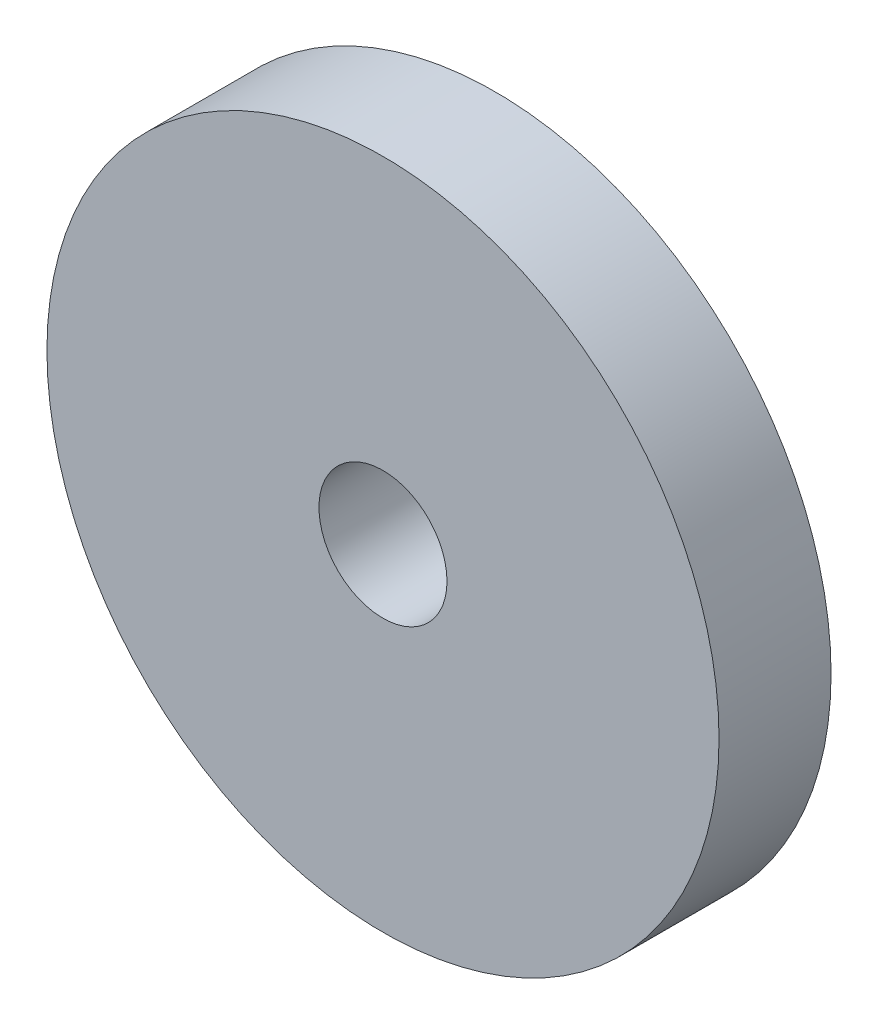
ISO-10303-21;
HEADER;
FILE_DESCRIPTION(('STEP AP214'),'2;1');
FILE_NAME('part.step','',(''),(''),'','','');
FILE_SCHEMA(('AUTOMOTIVE_DESIGN { 1 0 10303 214 1 1 1 1 }'));
ENDSEC;
DATA;
#1=APPLICATION_CONTEXT('core data for automotive mechanical design processes');
#2=APPLICATION_PROTOCOL_DEFINITION('international standard','automotive_design',2000,#1);
#3=PRODUCT_CONTEXT('',#1,'mechanical');
#4=PRODUCT('Part','Part','',(#3));
#5=PRODUCT_RELATED_PRODUCT_CATEGORY('part','',(#4));
#6=PRODUCT_DEFINITION_FORMATION('','',#4);
#7=PRODUCT_DEFINITION_CONTEXT('part definition',#1,'design');
#8=PRODUCT_DEFINITION('design','',#6,#7);
#9=PRODUCT_DEFINITION_SHAPE('','',#8);
#10=(LENGTH_UNIT() NAMED_UNIT(*) SI_UNIT(.MILLI.,.METRE.));
#11=(NAMED_UNIT(*) PLANE_ANGLE_UNIT() SI_UNIT($,.RADIAN.));
#12=(NAMED_UNIT(*) SI_UNIT($,.STERADIAN.) SOLID_ANGLE_UNIT());
#13=UNCERTAINTY_MEASURE_WITH_UNIT(LENGTH_MEASURE(1.E-05),#10,'distance_accuracy_value','');
#14=(GEOMETRIC_REPRESENTATION_CONTEXT(3) GLOBAL_UNCERTAINTY_ASSIGNED_CONTEXT((#13)) GLOBAL_UNIT_ASSIGNED_CONTEXT((#10,
#11,#12)) REPRESENTATION_CONTEXT('',''));
#15=CARTESIAN_POINT('',(0.,0.,0.));
#16=DIRECTION('',(0.,0.,1.));
#17=DIRECTION('',(1.,0.,0.));
#18=AXIS2_PLACEMENT_3D('',#15,#16,#17);
#19=CARTESIAN_POINT('',(0.,0.,3.5));
#20=DIRECTION('',(0.,0.,1.));
#21=DIRECTION('',(1.,0.,0.));
#22=AXIS2_PLACEMENT_3D('',#19,#20,#21);
#23=PLANE('',#22);
#24=CARTESIAN_POINT('',(0.,0.,3.5));
#25=DIRECTION('',(0.,0.,1.));
#26=DIRECTION('',(1.,0.,0.));
#27=AXIS2_PLACEMENT_3D('',#24,#25,#26);
#28=CIRCLE('',#27,4.);
#29=CARTESIAN_POINT('',(4.,0.,3.5));
#30=VERTEX_POINT('',#29);
#31=EDGE_CURVE('E30',#30,#30,#28,.T.);
#32=ORIENTED_EDGE('',*,*,#31,.F.);
#33=EDGE_LOOP('',(#32));
#34=FACE_BOUND('',#33,.T.);
#35=CARTESIAN_POINT('',(0.,0.,3.5));
#36=DIRECTION('',(0.,0.,-1.));
#37=DIRECTION('',(-1.,0.,0.));
#38=AXIS2_PLACEMENT_3D('',#35,#36,#37);
#39=CIRCLE('',#38,21.);
#40=CARTESIAN_POINT('',(-21.,0.,3.5));
#41=VERTEX_POINT('',#40);
#42=EDGE_CURVE('E10',#41,#41,#39,.T.);
#43=ORIENTED_EDGE('',*,*,#42,.F.);
#44=EDGE_LOOP('',(#43));
#45=FACE_BOUND('',#44,.T.);
#46=ADVANCED_FACE('F15',(#34,#45),#23,.T.);
#47=CARTESIAN_POINT('',(0.,0.,-3.5));
#48=DIRECTION('',(0.,0.,-1.));
#49=DIRECTION('',(-1.,0.,0.));
#50=AXIS2_PLACEMENT_3D('',#47,#48,#49);
#51=PLANE('',#50);
#52=CARTESIAN_POINT('',(0.,0.,-3.5));
#53=DIRECTION('',(0.,0.,-1.));
#54=DIRECTION('',(-1.,0.,0.));
#55=AXIS2_PLACEMENT_3D('',#52,#53,#54);
#56=CIRCLE('',#55,4.);
#57=CARTESIAN_POINT('',(-4.,0.,-3.5));
#58=VERTEX_POINT('',#57);
#59=EDGE_CURVE('E19',#58,#58,#56,.T.);
#60=ORIENTED_EDGE('',*,*,#59,.F.);
#61=EDGE_LOOP('',(#60));
#62=FACE_BOUND('',#61,.T.);
#63=CARTESIAN_POINT('',(0.,0.,-3.5));
#64=DIRECTION('',(0.,0.,1.));
#65=DIRECTION('',(1.,0.,0.));
#66=AXIS2_PLACEMENT_3D('',#63,#64,#65);
#67=CIRCLE('',#66,21.);
#68=CARTESIAN_POINT('',(21.,0.,-3.5));
#69=VERTEX_POINT('',#68);
#70=EDGE_CURVE('E23',#69,#69,#67,.T.);
#71=ORIENTED_EDGE('',*,*,#70,.F.);
#72=EDGE_LOOP('',(#71));
#73=FACE_BOUND('',#72,.T.);
#74=ADVANCED_FACE('F36',(#62,#73),#51,.T.);
#75=CARTESIAN_POINT('',(0.,0.,-3.5));
#76=DIRECTION('',(0.,0.,1.));
#77=DIRECTION('',(1.,0.,0.));
#78=AXIS2_PLACEMENT_3D('',#75,#76,#77);
#79=CYLINDRICAL_SURFACE('',#78,21.);
#80=ORIENTED_EDGE('',*,*,#42,.T.);
#81=EDGE_LOOP('',(#80));
#82=FACE_BOUND('',#81,.T.);
#83=ORIENTED_EDGE('',*,*,#70,.T.);
#84=EDGE_LOOP('',(#83));
#85=FACE_BOUND('',#84,.T.);
#86=ADVANCED_FACE('F17',(#82,#85),#79,.T.);
#87=CARTESIAN_POINT('',(0.,0.,-4.5));
#88=DIRECTION('',(0.,0.,1.));
#89=DIRECTION('',(1.,0.,0.));
#90=AXIS2_PLACEMENT_3D('',#87,#88,#89);
#91=CYLINDRICAL_SURFACE('',#90,4.);
#92=ORIENTED_EDGE('',*,*,#31,.T.);
#93=EDGE_LOOP('',(#92));
#94=FACE_BOUND('',#93,.T.);
#95=ORIENTED_EDGE('',*,*,#59,.T.);
#96=EDGE_LOOP('',(#95));
#97=FACE_BOUND('',#96,.T.);
#98=ADVANCED_FACE('F38',(#94,#97),#91,.F.);
#99=CLOSED_SHELL('',(#46,#74,#86,#98));
#100=MANIFOLD_SOLID_BREP('B1',#99);
#101=ADVANCED_BREP_SHAPE_REPRESENTATION('',(#18,#100),#14);
#102=SHAPE_DEFINITION_REPRESENTATION(#9,#101);
ENDSEC;
END-ISO-10303-21;
